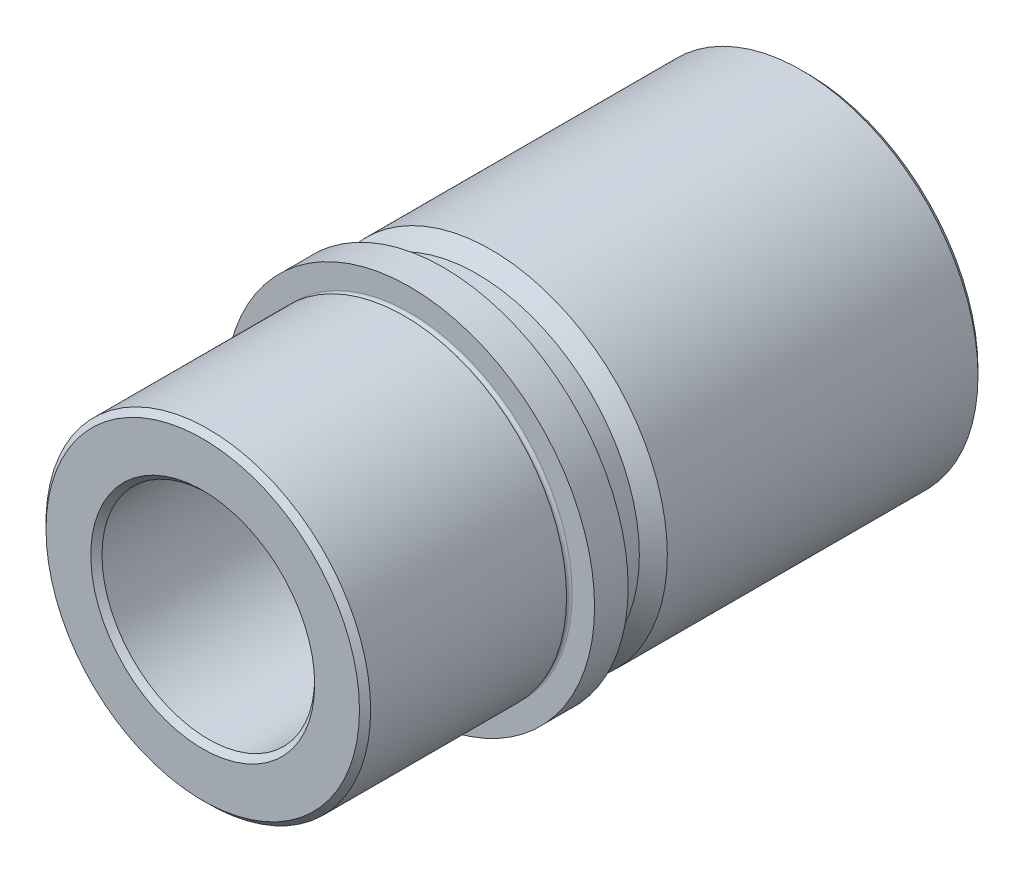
ISO-10303-21;
HEADER;
FILE_DESCRIPTION(('STEP AP214'),'2;1');
FILE_NAME('part.step','',(''),(''),'','','');
FILE_SCHEMA(('AUTOMOTIVE_DESIGN { 1 0 10303 214 1 1 1 1 }'));
ENDSEC;
DATA;
#1=APPLICATION_CONTEXT('core data for automotive mechanical design processes');
#2=APPLICATION_PROTOCOL_DEFINITION('international standard','automotive_design',2000,#1);
#3=PRODUCT_CONTEXT('',#1,'mechanical');
#4=PRODUCT('Part','Part','',(#3));
#5=PRODUCT_RELATED_PRODUCT_CATEGORY('part','',(#4));
#6=PRODUCT_DEFINITION_FORMATION('','',#4);
#7=PRODUCT_DEFINITION_CONTEXT('part definition',#1,'design');
#8=PRODUCT_DEFINITION('design','',#6,#7);
#9=PRODUCT_DEFINITION_SHAPE('','',#8);
#10=(LENGTH_UNIT() NAMED_UNIT(*) SI_UNIT(.MILLI.,.METRE.));
#11=(NAMED_UNIT(*) PLANE_ANGLE_UNIT() SI_UNIT($,.RADIAN.));
#12=(NAMED_UNIT(*) SI_UNIT($,.STERADIAN.) SOLID_ANGLE_UNIT());
#13=UNCERTAINTY_MEASURE_WITH_UNIT(LENGTH_MEASURE(1.E-05),#10,'distance_accuracy_value','');
#14=(GEOMETRIC_REPRESENTATION_CONTEXT(3) GLOBAL_UNCERTAINTY_ASSIGNED_CONTEXT((#13)) GLOBAL_UNIT_ASSIGNED_CONTEXT((#10,
#11,#12)) REPRESENTATION_CONTEXT('',''));
#15=CARTESIAN_POINT('',(0.,0.,0.));
#16=DIRECTION('',(0.,0.,1.));
#17=DIRECTION('',(1.,0.,0.));
#18=AXIS2_PLACEMENT_3D('',#15,#16,#17);
#19=CARTESIAN_POINT('',(0.,0.,-69.5));
#20=DIRECTION('',(0.,0.,1.));
#21=DIRECTION('',(1.,0.,0.));
#22=AXIS2_PLACEMENT_3D('',#19,#20,#21);
#23=TOROIDAL_SURFACE('',#22,19.5,0.499999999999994);
#24=CARTESIAN_POINT('',(0.,0.,-69.5));
#25=DIRECTION('',(0.,0.,1.));
#26=DIRECTION('',(1.,0.,0.));
#27=AXIS2_PLACEMENT_3D('',#24,#25,#26);
#28=CIRCLE('',#27,19.);
#29=CARTESIAN_POINT('',(19.,0.,-69.5));
#30=VERTEX_POINT('',#29);
#31=EDGE_CURVE('E81',#30,#30,#28,.T.);
#32=ORIENTED_EDGE('',*,*,#31,.T.);
#33=EDGE_LOOP('',(#32));
#34=FACE_BOUND('',#33,.T.);
#35=CARTESIAN_POINT('',(0.,0.,-70.));
#36=DIRECTION('',(0.,0.,1.));
#37=DIRECTION('',(1.,0.,0.));
#38=AXIS2_PLACEMENT_3D('',#35,#36,#37);
#39=CIRCLE('',#38,19.5);
#40=CARTESIAN_POINT('',(19.5,0.,-70.));
#41=VERTEX_POINT('',#40);
#42=EDGE_CURVE('E45',#41,#41,#39,.T.);
#43=ORIENTED_EDGE('',*,*,#42,.F.);
#44=EDGE_LOOP('',(#43));
#45=FACE_BOUND('',#44,.T.);
#46=ADVANCED_FACE('F13',(#34,#45),#23,.T.);
#47=CARTESIAN_POINT('',(0.,0.,-70.5));
#48=DIRECTION('',(0.,0.,1.));
#49=DIRECTION('',(1.,0.,0.));
#50=AXIS2_PLACEMENT_3D('',#47,#48,#49);
#51=TOROIDAL_SURFACE('',#50,19.5,0.500000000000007);
#52=CARTESIAN_POINT('',(0.,0.,-70.5));
#53=DIRECTION('',(0.,0.,1.));
#54=DIRECTION('',(1.,0.,0.));
#55=AXIS2_PLACEMENT_3D('',#52,#53,#54);
#56=CIRCLE('',#55,19.);
#57=CARTESIAN_POINT('',(19.,0.,-70.5));
#58=VERTEX_POINT('',#57);
#59=EDGE_CURVE('E48',#58,#58,#56,.T.);
#60=ORIENTED_EDGE('',*,*,#59,.F.);
#61=EDGE_LOOP('',(#60));
#62=FACE_BOUND('',#61,.T.);
#63=ORIENTED_EDGE('',*,*,#42,.T.);
#64=EDGE_LOOP('',(#63));
#65=FACE_BOUND('',#64,.T.);
#66=ADVANCED_FACE('F113',(#62,#65),#51,.T.);
#67=CARTESIAN_POINT('',(0.,0.,0.));
#68=DIRECTION('',(0.,0.,1.));
#69=DIRECTION('',(1.,0.,0.));
#70=AXIS2_PLACEMENT_3D('',#67,#68,#69);
#71=CYLINDRICAL_SURFACE('',#70,19.);
#72=CARTESIAN_POINT('',(0.,0.,-107.));
#73=DIRECTION('',(0.,0.,1.));
#74=DIRECTION('',(1.,0.,0.));
#75=AXIS2_PLACEMENT_3D('',#72,#73,#74);
#76=CIRCLE('',#75,19.);
#77=CARTESIAN_POINT('',(19.,0.,-107.));
#78=VERTEX_POINT('',#77);
#79=EDGE_CURVE('E36',#78,#78,#76,.F.);
#80=ORIENTED_EDGE('',*,*,#79,.T.);
#81=EDGE_LOOP('',(#80));
#82=FACE_BOUND('',#81,.T.);
#83=ORIENTED_EDGE('',*,*,#59,.T.);
#84=EDGE_LOOP('',(#83));
#85=FACE_BOUND('',#84,.T.);
#86=ADVANCED_FACE('F118',(#82,#85),#71,.F.);
#87=CARTESIAN_POINT('',(0.,0.,-108.));
#88=DIRECTION('',(0.,0.,1.));
#89=DIRECTION('',(1.,0.,0.));
#90=AXIS2_PLACEMENT_3D('',#87,#88,#89);
#91=PLANE('',#90);
#92=CARTESIAN_POINT('',(0.,0.,-108.));
#93=DIRECTION('',(0.,0.,1.));
#94=DIRECTION('',(1.,0.,0.));
#95=AXIS2_PLACEMENT_3D('',#92,#93,#94);
#96=CIRCLE('',#95,20.);
#97=CARTESIAN_POINT('',(20.,0.,-108.));
#98=VERTEX_POINT('',#97);
#99=EDGE_CURVE('E39',#98,#98,#96,.T.);
#100=ORIENTED_EDGE('',*,*,#99,.T.);
#101=EDGE_LOOP('',(#100));
#102=FACE_BOUND('',#101,.T.);
#103=CARTESIAN_POINT('',(0.,0.,-108.));
#104=DIRECTION('',(0.,0.,1.));
#105=DIRECTION('',(1.,0.,0.));
#106=AXIS2_PLACEMENT_3D('',#103,#104,#105);
#107=CIRCLE('',#106,30.5);
#108=CARTESIAN_POINT('',(30.5,0.,-108.));
#109=VERTEX_POINT('',#108);
#110=EDGE_CURVE('E42',#109,#109,#107,.F.);
#111=ORIENTED_EDGE('',*,*,#110,.T.);
#112=EDGE_LOOP('',(#111));
#113=FACE_BOUND('',#112,.T.);
#114=ADVANCED_FACE('F185',(#102,#113),#91,.F.);
#115=CARTESIAN_POINT('',(0.,0.,0.));
#116=DIRECTION('',(0.,0.,1.));
#117=DIRECTION('',(1.,0.,0.));
#118=AXIS2_PLACEMENT_3D('',#115,#116,#117);
#119=CYLINDRICAL_SURFACE('',#118,31.5);
#120=CARTESIAN_POINT('',(0.,0.,-107.));
#121=DIRECTION('',(0.,0.,1.));
#122=DIRECTION('',(1.,0.,0.));
#123=AXIS2_PLACEMENT_3D('',#120,#121,#122);
#124=CIRCLE('',#123,31.5);
#125=CARTESIAN_POINT('',(31.5,0.,-107.));
#126=VERTEX_POINT('',#125);
#127=EDGE_CURVE('E33',#126,#126,#124,.T.);
#128=ORIENTED_EDGE('',*,*,#127,.T.);
#129=EDGE_LOOP('',(#128));
#130=FACE_BOUND('',#129,.T.);
#131=CARTESIAN_POINT('',(0.,0.,-51.5));
#132=DIRECTION('',(0.,0.,1.));
#133=DIRECTION('',(1.,0.,0.));
#134=AXIS2_PLACEMENT_3D('',#131,#132,#133);
#135=CIRCLE('',#134,31.5);
#136=CARTESIAN_POINT('',(31.5,0.,-51.5));
#137=VERTEX_POINT('',#136);
#138=EDGE_CURVE('E51',#137,#137,#135,.T.);
#139=ORIENTED_EDGE('',*,*,#138,.F.);
#140=EDGE_LOOP('',(#139));
#141=FACE_BOUND('',#140,.T.);
#142=ADVANCED_FACE('F181',(#130,#141),#119,.T.);
#143=CARTESIAN_POINT('',(0.,0.,-49.));
#144=DIRECTION('',(0.,0.,-1.));
#145=DIRECTION('',(-1.,0.,0.));
#146=AXIS2_PLACEMENT_3D('',#143,#144,#145);
#147=CONICAL_SURFACE('',#146,29.,0.78539816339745);
#148=ORIENTED_EDGE('',*,*,#138,.T.);
#149=EDGE_LOOP('',(#148));
#150=FACE_BOUND('',#149,.T.);
#151=CARTESIAN_POINT('',(0.,0.,-49.));
#152=DIRECTION('',(0.,0.,1.));
#153=DIRECTION('',(1.,0.,0.));
#154=AXIS2_PLACEMENT_3D('',#151,#152,#153);
#155=CIRCLE('',#154,29.);
#156=CARTESIAN_POINT('',(29.,0.,-49.));
#157=VERTEX_POINT('',#156);
#158=EDGE_CURVE('E54',#157,#157,#155,.T.);
#159=ORIENTED_EDGE('',*,*,#158,.F.);
#160=EDGE_LOOP('',(#159));
#161=FACE_BOUND('',#160,.T.);
#162=ADVANCED_FACE('F177',(#150,#161),#147,.T.);
#163=CARTESIAN_POINT('',(0.,0.,0.));
#164=DIRECTION('',(0.,0.,1.));
#165=DIRECTION('',(1.,0.,0.));
#166=AXIS2_PLACEMENT_3D('',#163,#164,#165);
#167=CYLINDRICAL_SURFACE('',#166,29.);
#168=ORIENTED_EDGE('',*,*,#158,.T.);
#169=EDGE_LOOP('',(#168));
#170=FACE_BOUND('',#169,.T.);
#171=CARTESIAN_POINT('',(0.,0.,-43.));
#172=DIRECTION('',(0.,0.,1.));
#173=DIRECTION('',(1.,0.,0.));
#174=AXIS2_PLACEMENT_3D('',#171,#172,#173);
#175=CIRCLE('',#174,29.);
#176=CARTESIAN_POINT('',(29.,0.,-43.));
#177=VERTEX_POINT('',#176);
#178=EDGE_CURVE('E57',#177,#177,#175,.T.);
#179=ORIENTED_EDGE('',*,*,#178,.F.);
#180=EDGE_LOOP('',(#179));
#181=FACE_BOUND('',#180,.T.);
#182=ADVANCED_FACE('F173',(#170,#181),#167,.T.);
#183=CARTESIAN_POINT('',(0.,0.,-43.));
#184=DIRECTION('',(0.,0.,-1.));
#185=DIRECTION('',(-1.,0.,0.));
#186=AXIS2_PLACEMENT_3D('',#183,#184,#185);
#187=PLANE('',#186);
#188=ORIENTED_EDGE('',*,*,#178,.T.);
#189=EDGE_LOOP('',(#188));
#190=FACE_BOUND('',#189,.T.);
#191=CARTESIAN_POINT('',(0.,0.,-43.));
#192=DIRECTION('',(0.,0.,1.));
#193=DIRECTION('',(1.,0.,0.));
#194=AXIS2_PLACEMENT_3D('',#191,#192,#193);
#195=CIRCLE('',#194,33.);
#196=CARTESIAN_POINT('',(33.,0.,-43.));
#197=VERTEX_POINT('',#196);
#198=EDGE_CURVE('E60',#197,#197,#195,.T.);
#199=ORIENTED_EDGE('',*,*,#198,.F.);
#200=EDGE_LOOP('',(#199));
#201=FACE_BOUND('',#200,.T.);
#202=ADVANCED_FACE('F169',(#190,#201),#187,.T.);
#203=CARTESIAN_POINT('',(0.,0.,0.));
#204=DIRECTION('',(0.,0.,1.));
#205=DIRECTION('',(1.,0.,0.));
#206=AXIS2_PLACEMENT_3D('',#203,#204,#205);
#207=CYLINDRICAL_SURFACE('',#206,33.);
#208=ORIENTED_EDGE('',*,*,#198,.T.);
#209=EDGE_LOOP('',(#208));
#210=FACE_BOUND('',#209,.T.);
#211=CARTESIAN_POINT('',(0.,0.,-37.));
#212=DIRECTION('',(0.,0.,1.));
#213=DIRECTION('',(1.,0.,0.));
#214=AXIS2_PLACEMENT_3D('',#211,#212,#213);
#215=CIRCLE('',#214,33.);
#216=CARTESIAN_POINT('',(33.,0.,-37.));
#217=VERTEX_POINT('',#216);
#218=EDGE_CURVE('E63',#217,#217,#215,.T.);
#219=ORIENTED_EDGE('',*,*,#218,.F.);
#220=EDGE_LOOP('',(#219));
#221=FACE_BOUND('',#220,.T.);
#222=ADVANCED_FACE('F165',(#210,#221),#207,.T.);
#223=CARTESIAN_POINT('',(0.,0.,-37.));
#224=DIRECTION('',(0.,0.,1.));
#225=DIRECTION('',(1.,0.,0.));
#226=AXIS2_PLACEMENT_3D('',#223,#224,#225);
#227=PLANE('',#226);
#228=ORIENTED_EDGE('',*,*,#218,.T.);
#229=EDGE_LOOP('',(#228));
#230=FACE_BOUND('',#229,.T.);
#231=CARTESIAN_POINT('',(0.,0.,-37.));
#232=DIRECTION('',(0.,0.,1.));
#233=DIRECTION('',(1.,0.,0.));
#234=AXIS2_PLACEMENT_3D('',#231,#232,#233);
#235=CIRCLE('',#234,29.);
#236=CARTESIAN_POINT('',(29.,0.,-37.));
#237=VERTEX_POINT('',#236);
#238=EDGE_CURVE('E66',#237,#237,#235,.T.);
#239=ORIENTED_EDGE('',*,*,#238,.F.);
#240=EDGE_LOOP('',(#239));
#241=FACE_BOUND('',#240,.T.);
#242=ADVANCED_FACE('F161',(#230,#241),#227,.T.);
#243=CARTESIAN_POINT('',(0.,0.,-36.5));
#244=DIRECTION('',(0.,0.,1.));
#245=DIRECTION('',(1.,0.,0.));
#246=AXIS2_PLACEMENT_3D('',#243,#244,#245);
#247=TOROIDAL_SURFACE('',#246,29.,0.5);
#248=ORIENTED_EDGE('',*,*,#238,.T.);
#249=EDGE_LOOP('',(#248));
#250=FACE_BOUND('',#249,.T.);
#251=CARTESIAN_POINT('',(0.,0.,-36.));
#252=DIRECTION('',(0.,0.,1.));
#253=DIRECTION('',(1.,0.,0.));
#254=AXIS2_PLACEMENT_3D('',#251,#252,#253);
#255=CIRCLE('',#254,29.);
#256=CARTESIAN_POINT('',(29.,0.,-36.));
#257=VERTEX_POINT('',#256);
#258=EDGE_CURVE('E69',#257,#257,#255,.T.);
#259=ORIENTED_EDGE('',*,*,#258,.F.);
#260=EDGE_LOOP('',(#259));
#261=FACE_BOUND('',#260,.T.);
#262=ADVANCED_FACE('F156',(#250,#261),#247,.F.);
#263=CARTESIAN_POINT('',(0.,0.,0.));
#264=DIRECTION('',(0.,0.,1.));
#265=DIRECTION('',(1.,0.,0.));
#266=AXIS2_PLACEMENT_3D('',#263,#264,#265);
#267=CYLINDRICAL_SURFACE('',#266,29.);
#268=CARTESIAN_POINT('',(0.,0.,-0.99999999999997));
#269=DIRECTION('',(0.,0.,1.));
#270=DIRECTION('',(1.,0.,0.));
#271=AXIS2_PLACEMENT_3D('',#268,#269,#270);
#272=CIRCLE('',#271,29.);
#273=CARTESIAN_POINT('',(29.,0.,-0.99999999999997));
#274=VERTEX_POINT('',#273);
#275=EDGE_CURVE('E8',#274,#274,#272,.F.);
#276=ORIENTED_EDGE('',*,*,#275,.T.);
#277=EDGE_LOOP('',(#276));
#278=FACE_BOUND('',#277,.T.);
#279=ORIENTED_EDGE('',*,*,#258,.T.);
#280=EDGE_LOOP('',(#279));
#281=FACE_BOUND('',#280,.T.);
#282=ADVANCED_FACE('F149',(#278,#281),#267,.T.);
#283=CARTESIAN_POINT('',(0.,0.,0.));
#284=DIRECTION('',(0.,0.,1.));
#285=DIRECTION('',(1.,0.,0.));
#286=AXIS2_PLACEMENT_3D('',#283,#284,#285);
#287=PLANE('',#286);
#288=CARTESIAN_POINT('',(0.,0.,0.));
#289=DIRECTION('',(0.,0.,1.));
#290=DIRECTION('',(1.,0.,0.));
#291=AXIS2_PLACEMENT_3D('',#288,#289,#290);
#292=CIRCLE('',#291,20.);
#293=CARTESIAN_POINT('',(20.,0.,0.));
#294=VERTEX_POINT('',#293);
#295=EDGE_CURVE('E20',#294,#294,#292,.F.);
#296=ORIENTED_EDGE('',*,*,#295,.T.);
#297=EDGE_LOOP('',(#296));
#298=FACE_BOUND('',#297,.T.);
#299=CARTESIAN_POINT('',(0.,0.,0.));
#300=DIRECTION('',(0.,0.,1.));
#301=DIRECTION('',(1.,0.,0.));
#302=AXIS2_PLACEMENT_3D('',#299,#300,#301);
#303=CIRCLE('',#302,28.);
#304=CARTESIAN_POINT('',(28.,0.,0.));
#305=VERTEX_POINT('',#304);
#306=EDGE_CURVE('E24',#305,#305,#303,.T.);
#307=ORIENTED_EDGE('',*,*,#306,.T.);
#308=EDGE_LOOP('',(#307));
#309=FACE_BOUND('',#308,.T.);
#310=ADVANCED_FACE('F109',(#298,#309),#287,.T.);
#311=CARTESIAN_POINT('',(0.,0.,0.));
#312=DIRECTION('',(0.,0.,1.));
#313=DIRECTION('',(1.,0.,0.));
#314=AXIS2_PLACEMENT_3D('',#311,#312,#313);
#315=CYLINDRICAL_SURFACE('',#314,19.);
#316=CARTESIAN_POINT('',(0.,0.,-1.00000000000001));
#317=DIRECTION('',(0.,0.,1.));
#318=DIRECTION('',(1.,0.,0.));
#319=AXIS2_PLACEMENT_3D('',#316,#317,#318);
#320=CIRCLE('',#319,19.);
#321=CARTESIAN_POINT('',(19.,0.,-1.00000000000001));
#322=VERTEX_POINT('',#321);
#323=EDGE_CURVE('E28',#322,#322,#320,.T.);
#324=ORIENTED_EDGE('',*,*,#323,.T.);
#325=EDGE_LOOP('',(#324));
#326=FACE_BOUND('',#325,.T.);
#327=CARTESIAN_POINT('',(0.,0.,-28.5));
#328=DIRECTION('',(0.,0.,1.));
#329=DIRECTION('',(1.,0.,0.));
#330=AXIS2_PLACEMENT_3D('',#327,#328,#329);
#331=CIRCLE('',#330,19.);
#332=CARTESIAN_POINT('',(19.,0.,-28.5));
#333=VERTEX_POINT('',#332);
#334=EDGE_CURVE('E72',#333,#333,#331,.T.);
#335=ORIENTED_EDGE('',*,*,#334,.F.);
#336=EDGE_LOOP('',(#335));
#337=FACE_BOUND('',#336,.T.);
#338=ADVANCED_FACE('F102',(#326,#337),#315,.F.);
#339=CARTESIAN_POINT('',(0.,0.,-28.5));
#340=DIRECTION('',(0.,0.,1.));
#341=DIRECTION('',(1.,0.,0.));
#342=AXIS2_PLACEMENT_3D('',#339,#340,#341);
#343=TOROIDAL_SURFACE('',#342,19.5,0.5);
#344=ORIENTED_EDGE('',*,*,#334,.T.);
#345=EDGE_LOOP('',(#344));
#346=FACE_BOUND('',#345,.T.);
#347=CARTESIAN_POINT('',(0.,0.,-29.));
#348=DIRECTION('',(0.,0.,1.));
#349=DIRECTION('',(1.,0.,0.));
#350=AXIS2_PLACEMENT_3D('',#347,#348,#349);
#351=CIRCLE('',#350,19.5);
#352=CARTESIAN_POINT('',(19.5,0.,-29.));
#353=VERTEX_POINT('',#352);
#354=EDGE_CURVE('E75',#353,#353,#351,.T.);
#355=ORIENTED_EDGE('',*,*,#354,.F.);
#356=EDGE_LOOP('',(#355));
#357=FACE_BOUND('',#356,.T.);
#358=ADVANCED_FACE('F97',(#346,#357),#343,.T.);
#359=CARTESIAN_POINT('',(0.,0.,-29.5));
#360=DIRECTION('',(0.,0.,1.));
#361=DIRECTION('',(1.,0.,0.));
#362=AXIS2_PLACEMENT_3D('',#359,#360,#361);
#363=TOROIDAL_SURFACE('',#362,19.5,0.5);
#364=CARTESIAN_POINT('',(0.,0.,-29.5));
#365=DIRECTION('',(0.,0.,1.));
#366=DIRECTION('',(1.,0.,0.));
#367=AXIS2_PLACEMENT_3D('',#364,#365,#366);
#368=CIRCLE('',#367,19.);
#369=CARTESIAN_POINT('',(19.,0.,-29.5));
#370=VERTEX_POINT('',#369);
#371=EDGE_CURVE('E78',#370,#370,#368,.T.);
#372=ORIENTED_EDGE('',*,*,#371,.F.);
#373=EDGE_LOOP('',(#372));
#374=FACE_BOUND('',#373,.T.);
#375=ORIENTED_EDGE('',*,*,#354,.T.);
#376=EDGE_LOOP('',(#375));
#377=FACE_BOUND('',#376,.T.);
#378=ADVANCED_FACE('F91',(#374,#377),#363,.T.);
#379=CARTESIAN_POINT('',(0.,0.,0.));
#380=DIRECTION('',(0.,0.,1.));
#381=DIRECTION('',(1.,0.,0.));
#382=AXIS2_PLACEMENT_3D('',#379,#380,#381);
#383=CYLINDRICAL_SURFACE('',#382,19.);
#384=ORIENTED_EDGE('',*,*,#31,.F.);
#385=EDGE_LOOP('',(#384));
#386=FACE_BOUND('',#385,.T.);
#387=ORIENTED_EDGE('',*,*,#371,.T.);
#388=EDGE_LOOP('',(#387));
#389=FACE_BOUND('',#388,.T.);
#390=ADVANCED_FACE('F87',(#386,#389),#383,.F.);
#391=CARTESIAN_POINT('',(0.,0.,-108.));
#392=DIRECTION('',(0.,0.,-1.));
#393=DIRECTION('',(-1.,0.,0.));
#394=AXIS2_PLACEMENT_3D('',#391,#392,#393);
#395=CONICAL_SURFACE('',#394,20.,0.785398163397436);
#396=ORIENTED_EDGE('',*,*,#79,.F.);
#397=EDGE_LOOP('',(#396));
#398=FACE_BOUND('',#397,.T.);
#399=ORIENTED_EDGE('',*,*,#99,.F.);
#400=EDGE_LOOP('',(#399));
#401=FACE_BOUND('',#400,.T.);
#402=ADVANCED_FACE('F90',(#398,#401),#395,.F.);
#403=CARTESIAN_POINT('',(0.,0.,-107.));
#404=DIRECTION('',(0.,0.,1.));
#405=DIRECTION('',(1.,0.,0.));
#406=AXIS2_PLACEMENT_3D('',#403,#404,#405);
#407=CONICAL_SURFACE('',#406,31.5,0.785398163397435);
#408=ORIENTED_EDGE('',*,*,#110,.F.);
#409=EDGE_LOOP('',(#408));
#410=FACE_BOUND('',#409,.T.);
#411=ORIENTED_EDGE('',*,*,#127,.F.);
#412=EDGE_LOOP('',(#411));
#413=FACE_BOUND('',#412,.T.);
#414=ADVANCED_FACE('F125',(#410,#413),#407,.T.);
#415=CARTESIAN_POINT('',(0.,0.,-1.00000000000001));
#416=DIRECTION('',(0.,0.,1.));
#417=DIRECTION('',(1.,0.,0.));
#418=AXIS2_PLACEMENT_3D('',#415,#416,#417);
#419=CONICAL_SURFACE('',#418,19.,0.78539816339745);
#420=ORIENTED_EDGE('',*,*,#295,.F.);
#421=EDGE_LOOP('',(#420));
#422=FACE_BOUND('',#421,.T.);
#423=ORIENTED_EDGE('',*,*,#323,.F.);
#424=EDGE_LOOP('',(#423));
#425=FACE_BOUND('',#424,.T.);
#426=ADVANCED_FACE('F128',(#422,#425),#419,.F.);
#427=CARTESIAN_POINT('',(0.,0.,0.));
#428=DIRECTION('',(0.,0.,-1.));
#429=DIRECTION('',(-1.,0.,0.));
#430=AXIS2_PLACEMENT_3D('',#427,#428,#429);
#431=CONICAL_SURFACE('',#430,28.,0.785398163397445);
#432=ORIENTED_EDGE('',*,*,#275,.F.);
#433=EDGE_LOOP('',(#432));
#434=FACE_BOUND('',#433,.T.);
#435=ORIENTED_EDGE('',*,*,#306,.F.);
#436=EDGE_LOOP('',(#435));
#437=FACE_BOUND('',#436,.T.);
#438=ADVANCED_FACE('F15',(#434,#437),#431,.T.);
#439=CLOSED_SHELL('',(#46,#66,#86,#114,#142,#162,#182,#202,#222,#242,#262,#282,#310,#338,#358,
#378,#390,#402,#414,#426,#438));
#440=MANIFOLD_SOLID_BREP('B1',#439);
#441=ADVANCED_BREP_SHAPE_REPRESENTATION('',(#18,#440),#14);
#442=SHAPE_DEFINITION_REPRESENTATION(#9,#441);
ENDSEC;
END-ISO-10303-21;
